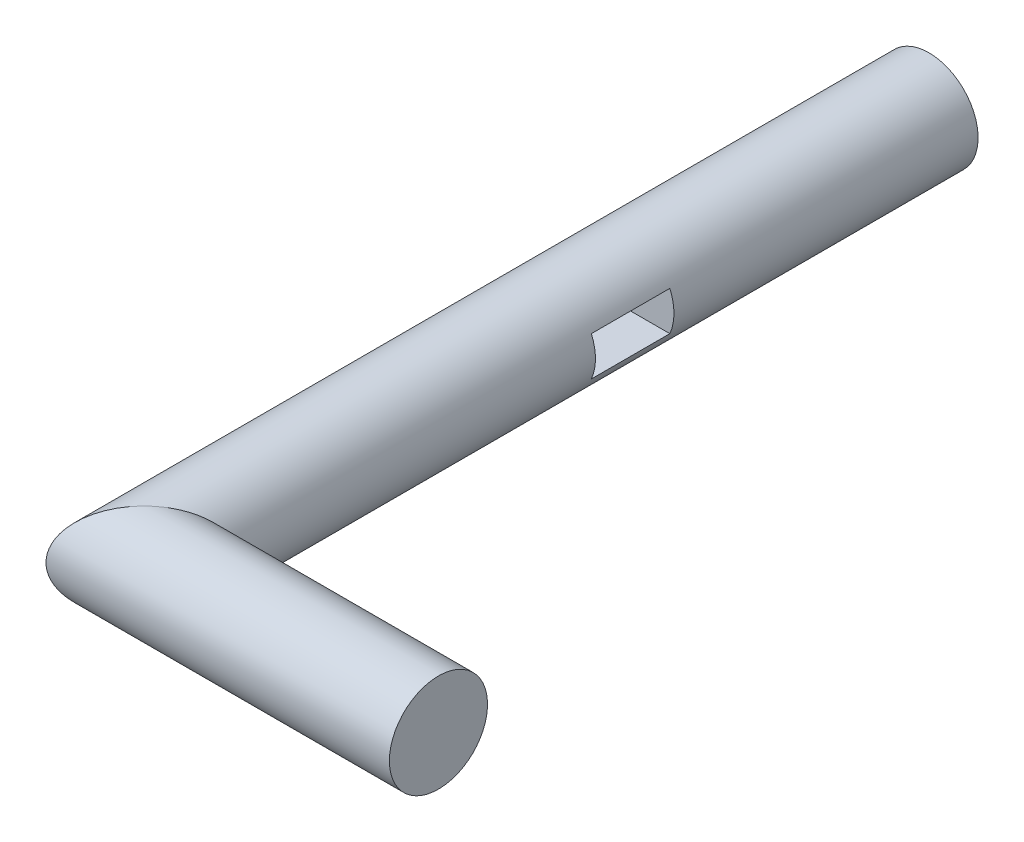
ISO-10303-21;
HEADER;
FILE_DESCRIPTION(('STEP AP214'),'2;1');
FILE_NAME('part.step','',(''),(''),'','','');
FILE_SCHEMA(('AUTOMOTIVE_DESIGN { 1 0 10303 214 1 1 1 1 }'));
ENDSEC;
DATA;
#1=APPLICATION_CONTEXT('core data for automotive mechanical design processes');
#2=APPLICATION_PROTOCOL_DEFINITION('international standard','automotive_design',2000,#1);
#3=PRODUCT_CONTEXT('',#1,'mechanical');
#4=PRODUCT('Part','Part','',(#3));
#5=PRODUCT_RELATED_PRODUCT_CATEGORY('part','',(#4));
#6=PRODUCT_DEFINITION_FORMATION('','',#4);
#7=PRODUCT_DEFINITION_CONTEXT('part definition',#1,'design');
#8=PRODUCT_DEFINITION('design','',#6,#7);
#9=PRODUCT_DEFINITION_SHAPE('','',#8);
#10=(LENGTH_UNIT() NAMED_UNIT(*) SI_UNIT(.MILLI.,.METRE.));
#11=(NAMED_UNIT(*) PLANE_ANGLE_UNIT() SI_UNIT($,.RADIAN.));
#12=(NAMED_UNIT(*) SI_UNIT($,.STERADIAN.) SOLID_ANGLE_UNIT());
#13=UNCERTAINTY_MEASURE_WITH_UNIT(LENGTH_MEASURE(1.E-05),#10,'distance_accuracy_value','');
#14=(GEOMETRIC_REPRESENTATION_CONTEXT(3) GLOBAL_UNCERTAINTY_ASSIGNED_CONTEXT((#13)) GLOBAL_UNIT_ASSIGNED_CONTEXT((#10,
#11,#12)) REPRESENTATION_CONTEXT('',''));
#15=CARTESIAN_POINT('',(0.,0.,0.));
#16=DIRECTION('',(0.,0.,1.));
#17=DIRECTION('',(1.,0.,0.));
#18=AXIS2_PLACEMENT_3D('',#15,#16,#17);
#19=CARTESIAN_POINT('',(30.,0.,10.));
#20=DIRECTION('',(-1.,0.,0.));
#21=DIRECTION('',(0.,0.,1.));
#22=AXIS2_PLACEMENT_3D('',#19,#20,#21);
#23=PLANE('',#22);
#24=CARTESIAN_POINT('',(30.,0.,10.));
#25=DIRECTION('',(-1.,0.,0.));
#26=DIRECTION('',(0.,0.,1.));
#27=AXIS2_PLACEMENT_3D('',#24,#25,#26);
#28=CIRCLE('',#27,5.);
#29=CARTESIAN_POINT('',(30.,0.,15.));
#30=VERTEX_POINT('',#29);
#31=EDGE_CURVE('E130',#30,#30,#28,.T.);
#32=ORIENTED_EDGE('',*,*,#31,.F.);
#33=EDGE_LOOP('',(#32));
#34=FACE_BOUND('',#33,.T.);
#35=ADVANCED_FACE('F51',(#34),#23,.F.);
#36=CARTESIAN_POINT('',(0.,0.,-70.));
#37=DIRECTION('',(0.,0.,-1.));
#38=DIRECTION('',(-1.,0.,0.));
#39=AXIS2_PLACEMENT_3D('',#36,#37,#38);
#40=PLANE('',#39);
#41=CARTESIAN_POINT('',(0.,0.,-70.));
#42=DIRECTION('',(0.,0.,-1.));
#43=DIRECTION('',(-1.,0.,0.));
#44=AXIS2_PLACEMENT_3D('',#41,#42,#43);
#45=CIRCLE('',#44,5.);
#46=CARTESIAN_POINT('',(-5.,0.,-70.));
#47=VERTEX_POINT('',#46);
#48=EDGE_CURVE('E124',#47,#47,#45,.T.);
#49=ORIENTED_EDGE('',*,*,#48,.T.);
#50=EDGE_LOOP('',(#49));
#51=FACE_BOUND('',#50,.T.);
#52=ADVANCED_FACE('F164',(#51),#40,.T.);
#53=CARTESIAN_POINT('',(-5.6,0.,10.));
#54=DIRECTION('',(1.,0.,0.));
#55=DIRECTION('',(0.,0.,-1.));
#56=AXIS2_PLACEMENT_3D('',#53,#54,#55);
#57=CYLINDRICAL_SURFACE('',#56,5.);
#58=CARTESIAN_POINT('',(0.,0.,9.99999999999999));
#59=DIRECTION('',(0.707106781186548,0.,0.707106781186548));
#60=DIRECTION('',(-0.707106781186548,0.,0.707106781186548));
#61=AXIS2_PLACEMENT_3D('',#58,#59,#60);
#62=ELLIPSE('',#61,7.07106781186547,5.);
#63=CARTESIAN_POINT('',(-5.,0.,15.));
#64=VERTEX_POINT('',#63);
#65=EDGE_CURVE('E118',#64,#64,#62,.T.);
#66=ORIENTED_EDGE('',*,*,#65,.T.);
#67=EDGE_LOOP('',(#66));
#68=FACE_BOUND('',#67,.T.);
#69=ORIENTED_EDGE('',*,*,#31,.T.);
#70=EDGE_LOOP('',(#69));
#71=FACE_BOUND('',#70,.T.);
#72=ADVANCED_FACE('F160',(#68,#71),#57,.T.);
#73=CARTESIAN_POINT('',(0.,0.,-70.));
#74=DIRECTION('',(0.,0.,1.));
#75=DIRECTION('',(1.,0.,0.));
#76=AXIS2_PLACEMENT_3D('',#73,#74,#75);
#77=CYLINDRICAL_SURFACE('',#76,5.);
#78=DIRECTION('',(0.,0.,1.));
#79=VECTOR('',#78,1.);
#80=CARTESIAN_POINT('',(4.58257569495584,-2.,-70.));
#81=LINE('',#80,#79);
#82=CARTESIAN_POINT('',(4.58257569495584,-2.,-39.));
#83=VERTEX_POINT('',#82);
#84=CARTESIAN_POINT('',(4.58257569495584,-2.,-31.));
#85=VERTEX_POINT('',#84);
#86=EDGE_CURVE('E89',#83,#85,#81,.T.);
#87=ORIENTED_EDGE('',*,*,#86,.T.);
#88=CARTESIAN_POINT('',(0.,0.,-31.));
#89=DIRECTION('',(0.,0.,1.));
#90=DIRECTION('',(1.,0.,0.));
#91=AXIS2_PLACEMENT_3D('',#88,#89,#90);
#92=CIRCLE('',#91,5.);
#93=CARTESIAN_POINT('',(4.58257569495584,2.,-31.));
#94=VERTEX_POINT('',#93);
#95=EDGE_CURVE('E59',#85,#94,#92,.T.);
#96=ORIENTED_EDGE('',*,*,#95,.T.);
#97=DIRECTION('',(0.,0.,1.));
#98=VECTOR('',#97,1.);
#99=CARTESIAN_POINT('',(4.58257569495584,2.,-70.));
#100=LINE('',#99,#98);
#101=CARTESIAN_POINT('',(4.58257569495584,2.,-39.));
#102=VERTEX_POINT('',#101);
#103=EDGE_CURVE('E110',#94,#102,#100,.F.);
#104=ORIENTED_EDGE('',*,*,#103,.T.);
#105=CARTESIAN_POINT('',(0.,0.,-39.));
#106=DIRECTION('',(0.,0.,-1.));
#107=DIRECTION('',(-1.,0.,0.));
#108=AXIS2_PLACEMENT_3D('',#105,#106,#107);
#109=CIRCLE('',#108,5.);
#110=EDGE_CURVE('E95',#102,#83,#109,.T.);
#111=ORIENTED_EDGE('',*,*,#110,.T.);
#112=EDGE_LOOP('',(#87,#96,#104,#111));
#113=FACE_BOUND('',#112,.T.);
#114=DIRECTION('',(0.,0.,1.));
#115=VECTOR('',#114,1.);
#116=CARTESIAN_POINT('',(-4.58257569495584,2.,-70.));
#117=LINE('',#116,#115);
#118=CARTESIAN_POINT('',(-4.58257569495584,2.,-39.));
#119=VERTEX_POINT('',#118);
#120=CARTESIAN_POINT('',(-4.58257569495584,2.,-31.));
#121=VERTEX_POINT('',#120);
#122=EDGE_CURVE('E12',#119,#121,#117,.T.);
#123=ORIENTED_EDGE('',*,*,#122,.T.);
#124=CARTESIAN_POINT('',(-4.58257569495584,-2.,-31.));
#125=VERTEX_POINT('',#124);
#126=EDGE_CURVE('E117',#121,#125,#92,.T.);
#127=ORIENTED_EDGE('',*,*,#126,.T.);
#128=DIRECTION('',(0.,0.,1.));
#129=VECTOR('',#128,1.);
#130=CARTESIAN_POINT('',(-4.58257569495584,-2.,-70.));
#131=LINE('',#130,#129);
#132=CARTESIAN_POINT('',(-4.58257569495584,-2.,-39.));
#133=VERTEX_POINT('',#132);
#134=EDGE_CURVE('E96',#125,#133,#131,.F.);
#135=ORIENTED_EDGE('',*,*,#134,.T.);
#136=EDGE_CURVE('E102',#133,#119,#109,.T.);
#137=ORIENTED_EDGE('',*,*,#136,.T.);
#138=EDGE_LOOP('',(#123,#127,#135,#137));
#139=FACE_BOUND('',#138,.T.);
#140=ORIENTED_EDGE('',*,*,#48,.F.);
#141=EDGE_LOOP('',(#140));
#142=FACE_BOUND('',#141,.T.);
#143=ORIENTED_EDGE('',*,*,#65,.F.);
#144=EDGE_LOOP('',(#143));
#145=FACE_BOUND('',#144,.T.);
#146=ADVANCED_FACE('F108',(#113,#139,#142,#145),#77,.T.);
#147=CARTESIAN_POINT('',(-5.,2.,-31.));
#148=DIRECTION('',(0.,0.,1.));
#149=DIRECTION('',(1.,0.,0.));
#150=AXIS2_PLACEMENT_3D('',#147,#148,#149);
#151=PLANE('',#150);
#152=DIRECTION('',(1.,0.,0.));
#153=VECTOR('',#152,1.);
#154=CARTESIAN_POINT('',(-5.,2.,-31.));
#155=LINE('',#154,#153);
#156=EDGE_CURVE('E135',#121,#94,#155,.T.);
#157=ORIENTED_EDGE('',*,*,#156,.T.);
#158=ORIENTED_EDGE('',*,*,#95,.F.);
#159=DIRECTION('',(1.,0.,0.));
#160=VECTOR('',#159,1.);
#161=CARTESIAN_POINT('',(-5.,-2.,-31.));
#162=LINE('',#161,#160);
#163=EDGE_CURVE('E66',#125,#85,#162,.T.);
#164=ORIENTED_EDGE('',*,*,#163,.F.);
#165=ORIENTED_EDGE('',*,*,#126,.F.);
#166=EDGE_LOOP('',(#157,#158,#164,#165));
#167=FACE_BOUND('',#166,.T.);
#168=ADVANCED_FACE('F149',(#167),#151,.F.);
#169=CARTESIAN_POINT('',(-5.,2.,-31.));
#170=DIRECTION('',(0.,1.,0.));
#171=DIRECTION('',(0.,0.,1.));
#172=AXIS2_PLACEMENT_3D('',#169,#170,#171);
#173=PLANE('',#172);
#174=DIRECTION('',(1.,0.,0.));
#175=VECTOR('',#174,1.);
#176=CARTESIAN_POINT('',(-5.,2.,-39.));
#177=LINE('',#176,#175);
#178=EDGE_CURVE('E105',#119,#102,#177,.T.);
#179=ORIENTED_EDGE('',*,*,#178,.T.);
#180=ORIENTED_EDGE('',*,*,#103,.F.);
#181=ORIENTED_EDGE('',*,*,#156,.F.);
#182=ORIENTED_EDGE('',*,*,#122,.F.);
#183=EDGE_LOOP('',(#179,#180,#181,#182));
#184=FACE_BOUND('',#183,.T.);
#185=ADVANCED_FACE('F147',(#184),#173,.F.);
#186=CARTESIAN_POINT('',(-5.,2.,-39.));
#187=DIRECTION('',(0.,0.,-1.));
#188=DIRECTION('',(-1.,0.,0.));
#189=AXIS2_PLACEMENT_3D('',#186,#187,#188);
#190=PLANE('',#189);
#191=ORIENTED_EDGE('',*,*,#178,.F.);
#192=ORIENTED_EDGE('',*,*,#136,.F.);
#193=DIRECTION('',(1.,0.,0.));
#194=VECTOR('',#193,1.);
#195=CARTESIAN_POINT('',(-5.,-2.,-39.));
#196=LINE('',#195,#194);
#197=EDGE_CURVE('E71',#133,#83,#196,.T.);
#198=ORIENTED_EDGE('',*,*,#197,.T.);
#199=ORIENTED_EDGE('',*,*,#110,.F.);
#200=EDGE_LOOP('',(#191,#192,#198,#199));
#201=FACE_BOUND('',#200,.T.);
#202=ADVANCED_FACE('F100',(#201),#190,.F.);
#203=CARTESIAN_POINT('',(-5.,-2.,-31.));
#204=DIRECTION('',(0.,-1.,0.));
#205=DIRECTION('',(0.,0.,-1.));
#206=AXIS2_PLACEMENT_3D('',#203,#204,#205);
#207=PLANE('',#206);
#208=ORIENTED_EDGE('',*,*,#197,.F.);
#209=ORIENTED_EDGE('',*,*,#134,.F.);
#210=ORIENTED_EDGE('',*,*,#163,.T.);
#211=ORIENTED_EDGE('',*,*,#86,.F.);
#212=EDGE_LOOP('',(#208,#209,#210,#211));
#213=FACE_BOUND('',#212,.T.);
#214=ADVANCED_FACE('F90',(#213),#207,.F.);
#215=CLOSED_SHELL('',(#35,#52,#72,#146,#168,#185,#202,#214));
#216=MANIFOLD_SOLID_BREP('B2',#215);
#217=ADVANCED_BREP_SHAPE_REPRESENTATION('',(#18,#216),#14);
#218=SHAPE_DEFINITION_REPRESENTATION(#9,#217);
ENDSEC;
END-ISO-10303-21;
